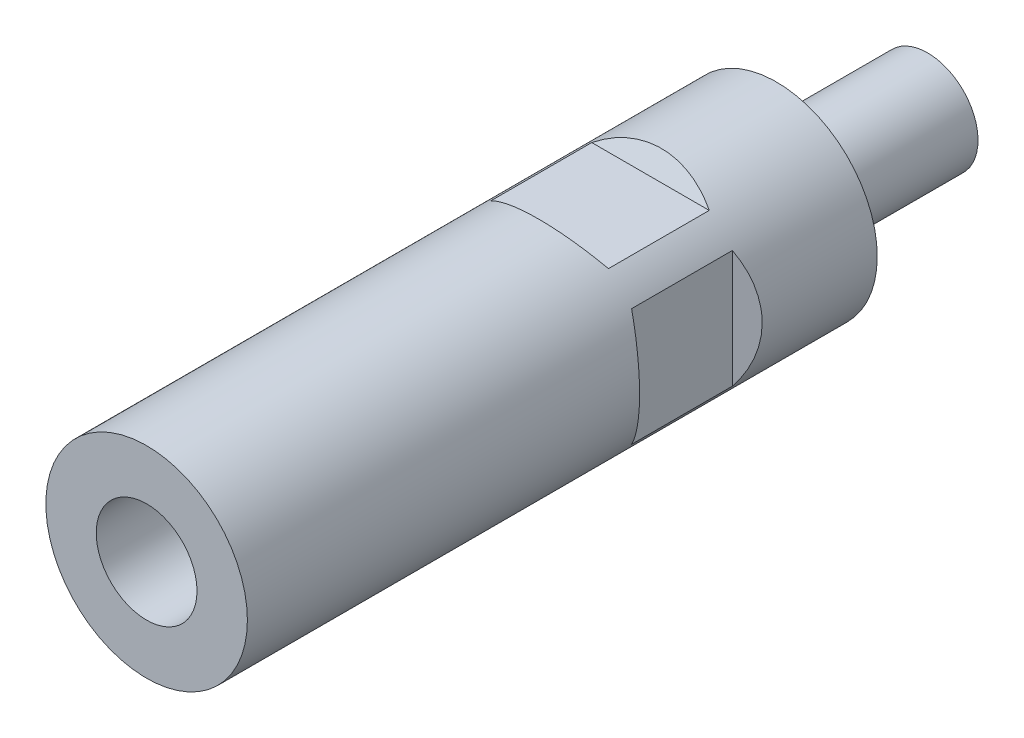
ISO-10303-21;
HEADER;
FILE_DESCRIPTION(('STEP AP214'),'2;1');
FILE_NAME('part.step','',(''),(''),'','','');
FILE_SCHEMA(('AUTOMOTIVE_DESIGN { 1 0 10303 214 1 1 1 1 }'));
ENDSEC;
DATA;
#1=APPLICATION_CONTEXT('core data for automotive mechanical design processes');
#2=APPLICATION_PROTOCOL_DEFINITION('international standard','automotive_design',2000,#1);
#3=PRODUCT_CONTEXT('',#1,'mechanical');
#4=PRODUCT('Part','Part','',(#3));
#5=PRODUCT_RELATED_PRODUCT_CATEGORY('part','',(#4));
#6=PRODUCT_DEFINITION_FORMATION('','',#4);
#7=PRODUCT_DEFINITION_CONTEXT('part definition',#1,'design');
#8=PRODUCT_DEFINITION('design','',#6,#7);
#9=PRODUCT_DEFINITION_SHAPE('','',#8);
#10=(LENGTH_UNIT() NAMED_UNIT(*) SI_UNIT(.MILLI.,.METRE.));
#11=(NAMED_UNIT(*) PLANE_ANGLE_UNIT() SI_UNIT($,.RADIAN.));
#12=(NAMED_UNIT(*) SI_UNIT($,.STERADIAN.) SOLID_ANGLE_UNIT());
#13=UNCERTAINTY_MEASURE_WITH_UNIT(LENGTH_MEASURE(1.E-05),#10,'distance_accuracy_value','');
#14=(GEOMETRIC_REPRESENTATION_CONTEXT(3) GLOBAL_UNCERTAINTY_ASSIGNED_CONTEXT((#13)) GLOBAL_UNIT_ASSIGNED_CONTEXT((#10,
#11,#12)) REPRESENTATION_CONTEXT('',''));
#15=CARTESIAN_POINT('',(0.,0.,0.));
#16=DIRECTION('',(0.,0.,1.));
#17=DIRECTION('',(1.,0.,0.));
#18=AXIS2_PLACEMENT_3D('',#15,#16,#17);
#19=CARTESIAN_POINT('',(0.,0.,8.));
#20=DIRECTION('',(0.,0.,1.));
#21=DIRECTION('',(0.,-1.,0.));
#22=AXIS2_PLACEMENT_3D('',#19,#20,#21);
#23=CYLINDRICAL_SURFACE('',#22,4.);
#24=CARTESIAN_POINT('',(0.,0.,-12.));
#25=DIRECTION('',(0.,0.,1.));
#26=DIRECTION('',(0.,-1.,0.));
#27=AXIS2_PLACEMENT_3D('',#24,#25,#26);
#28=CIRCLE('',#27,4.);
#29=CARTESIAN_POINT('',(0.,-4.,-12.));
#30=VERTEX_POINT('',#29);
#31=EDGE_CURVE('E22',#30,#30,#28,.F.);
#32=ORIENTED_EDGE('',*,*,#31,.F.);
#33=EDGE_LOOP('',(#32));
#34=FACE_BOUND('',#33,.T.);
#35=CARTESIAN_POINT('',(0.,0.,0.));
#36=DIRECTION('',(0.,0.,1.));
#37=DIRECTION('',(1.,0.,0.));
#38=AXIS2_PLACEMENT_3D('',#35,#36,#37);
#39=CIRCLE('',#38,4.);
#40=CARTESIAN_POINT('',(4.,0.,0.));
#41=VERTEX_POINT('',#40);
#42=EDGE_CURVE('E9',#41,#41,#39,.T.);
#43=ORIENTED_EDGE('',*,*,#42,.F.);
#44=EDGE_LOOP('',(#43));
#45=FACE_BOUND('',#44,.T.);
#46=ADVANCED_FACE('F14',(#34,#45),#23,.T.);
#47=CARTESIAN_POINT('',(0.,0.,-12.));
#48=DIRECTION('',(0.,0.,1.));
#49=DIRECTION('',(0.,-1.,0.));
#50=AXIS2_PLACEMENT_3D('',#47,#48,#49);
#51=PLANE('',#50);
#52=ORIENTED_EDGE('',*,*,#31,.T.);
#53=EDGE_LOOP('',(#52));
#54=FACE_BOUND('',#53,.T.);
#55=ADVANCED_FACE('F16',(#54),#51,.F.);
#56=CARTESIAN_POINT('',(3.4,0.,30.));
#57=DIRECTION('',(0.,0.,-1.));
#58=DIRECTION('',(-1.,0.,0.));
#59=AXIS2_PLACEMENT_3D('',#56,#57,#58);
#60=PLANE('',#59);
#61=CARTESIAN_POINT('',(0.,0.,30.));
#62=DIRECTION('',(0.,0.,1.));
#63=DIRECTION('',(1.,0.,0.));
#64=AXIS2_PLACEMENT_3D('',#61,#62,#63);
#65=CIRCLE('',#64,4.);
#66=CARTESIAN_POINT('',(4.,0.,30.));
#67=VERTEX_POINT('',#66);
#68=EDGE_CURVE('E251',#67,#67,#65,.T.);
#69=ORIENTED_EDGE('',*,*,#68,.T.);
#70=EDGE_LOOP('',(#69));
#71=FACE_BOUND('',#70,.T.);
#72=ADVANCED_FACE('F125',(#71),#60,.F.);
#73=CARTESIAN_POINT('',(0.,0.,50.));
#74=DIRECTION('',(0.,0.,1.));
#75=DIRECTION('',(1.,0.,0.));
#76=AXIS2_PLACEMENT_3D('',#73,#74,#75);
#77=CYLINDRICAL_SURFACE('',#76,4.);
#78=ORIENTED_EDGE('',*,*,#68,.F.);
#79=EDGE_LOOP('',(#78));
#80=FACE_BOUND('',#79,.T.);
#81=CARTESIAN_POINT('',(0.,0.,50.));
#82=DIRECTION('',(0.,0.,1.));
#83=DIRECTION('',(1.,0.,0.));
#84=AXIS2_PLACEMENT_3D('',#81,#82,#83);
#85=CIRCLE('',#84,4.);
#86=CARTESIAN_POINT('',(4.,0.,50.));
#87=VERTEX_POINT('',#86);
#88=EDGE_CURVE('E96',#87,#87,#85,.T.);
#89=ORIENTED_EDGE('',*,*,#88,.T.);
#90=EDGE_LOOP('',(#89));
#91=FACE_BOUND('',#90,.T.);
#92=ADVANCED_FACE('F127',(#80,#91),#77,.F.);
#93=CARTESIAN_POINT('',(0.,0.,50.));
#94=DIRECTION('',(0.,0.,1.));
#95=DIRECTION('',(1.,0.,0.));
#96=AXIS2_PLACEMENT_3D('',#93,#94,#95);
#97=PLANE('',#96);
#98=ORIENTED_EDGE('',*,*,#88,.F.);
#99=EDGE_LOOP('',(#98));
#100=FACE_BOUND('',#99,.T.);
#101=CARTESIAN_POINT('',(0.,0.,50.));
#102=DIRECTION('',(0.,0.,1.));
#103=DIRECTION('',(1.,0.,0.));
#104=AXIS2_PLACEMENT_3D('',#101,#102,#103);
#105=CIRCLE('',#104,8.);
#106=CARTESIAN_POINT('',(8.,0.,50.));
#107=VERTEX_POINT('',#106);
#108=EDGE_CURVE('E239',#107,#107,#105,.T.);
#109=ORIENTED_EDGE('',*,*,#108,.T.);
#110=EDGE_LOOP('',(#109));
#111=FACE_BOUND('',#110,.T.);
#112=ADVANCED_FACE('F134',(#100,#111),#97,.T.);
#113=CARTESIAN_POINT('',(6.5,-8.,18.));
#114=DIRECTION('',(-0.5,0.,0.866025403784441));
#115=DIRECTION('',(0.86602540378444,0.,0.5));
#116=AXIS2_PLACEMENT_3D('',#113,#114,#115);
#117=PLANE('',#116);
#118=DIRECTION('',(0.,1.,0.));
#119=VECTOR('',#118,1.);
#120=CARTESIAN_POINT('',(6.5,-8.,18.));
#121=LINE('',#120,#119);
#122=CARTESIAN_POINT('',(6.5,-4.66368952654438,18.));
#123=VERTEX_POINT('',#122);
#124=CARTESIAN_POINT('',(6.5,4.66368952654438,18.));
#125=VERTEX_POINT('',#124);
#126=EDGE_CURVE('E183',#123,#125,#121,.T.);
#127=ORIENTED_EDGE('',*,*,#126,.T.);
#128=CARTESIAN_POINT('',(0.,0.,14.2472232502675));
#129=DIRECTION('',(-0.5,0.,0.866025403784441));
#130=DIRECTION('',(-0.86602540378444,0.,-0.5));
#131=AXIS2_PLACEMENT_3D('',#128,#129,#130);
#132=ELLIPSE('',#131,9.23760430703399,8.);
#133=EDGE_CURVE('E35',#123,#125,#132,.T.);
#134=ORIENTED_EDGE('',*,*,#133,.F.);
#135=EDGE_LOOP('',(#127,#134));
#136=FACE_BOUND('',#135,.T.);
#137=ADVANCED_FACE('F175',(#136),#117,.F.);
#138=CARTESIAN_POINT('',(6.5,-8.,18.));
#139=DIRECTION('',(-1.,0.,0.));
#140=DIRECTION('',(0.,0.,1.));
#141=AXIS2_PLACEMENT_3D('',#138,#139,#140);
#142=PLANE('',#141);
#143=ORIENTED_EDGE('',*,*,#126,.F.);
#144=DIRECTION('',(0.,0.,-1.));
#145=VECTOR('',#144,1.);
#146=CARTESIAN_POINT('',(6.5,-4.66368952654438,50.));
#147=LINE('',#146,#145);
#148=CARTESIAN_POINT('',(6.5,-4.66368952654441,10.));
#149=VERTEX_POINT('',#148);
#150=EDGE_CURVE('E191',#149,#123,#147,.F.);
#151=ORIENTED_EDGE('',*,*,#150,.F.);
#152=DIRECTION('',(0.,1.,0.));
#153=VECTOR('',#152,1.);
#154=CARTESIAN_POINT('',(6.5,-8.,10.));
#155=LINE('',#154,#153);
#156=CARTESIAN_POINT('',(6.5,4.66368952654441,10.));
#157=VERTEX_POINT('',#156);
#158=EDGE_CURVE('E187',#149,#157,#155,.T.);
#159=ORIENTED_EDGE('',*,*,#158,.T.);
#160=DIRECTION('',(0.,0.,-1.));
#161=VECTOR('',#160,1.);
#162=CARTESIAN_POINT('',(6.5,4.66368952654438,50.));
#163=LINE('',#162,#161);
#164=EDGE_CURVE('E29',#125,#157,#163,.T.);
#165=ORIENTED_EDGE('',*,*,#164,.F.);
#166=EDGE_LOOP('',(#143,#151,#159,#165));
#167=FACE_BOUND('',#166,.T.);
#168=ADVANCED_FACE('F172',(#167),#142,.F.);
#169=CARTESIAN_POINT('',(6.5,-8.,10.));
#170=DIRECTION('',(-0.5,0.,-0.866025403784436));
#171=DIRECTION('',(-0.866025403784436,0.,0.5));
#172=AXIS2_PLACEMENT_3D('',#169,#170,#171);
#173=PLANE('',#172);
#174=CARTESIAN_POINT('',(0.,0.,13.7527767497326));
#175=DIRECTION('',(-0.5,0.,-0.866025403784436));
#176=DIRECTION('',(0.866025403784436,0.,-0.5));
#177=AXIS2_PLACEMENT_3D('',#174,#175,#176);
#178=ELLIPSE('',#177,9.23760430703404,8.);
#179=EDGE_CURVE('E195',#157,#149,#178,.T.);
#180=ORIENTED_EDGE('',*,*,#179,.F.);
#181=ORIENTED_EDGE('',*,*,#158,.F.);
#182=EDGE_LOOP('',(#180,#181));
#183=FACE_BOUND('',#182,.T.);
#184=ADVANCED_FACE('F167',(#183),#173,.F.);
#185=CARTESIAN_POINT('',(-6.5,-8.,10.));
#186=DIRECTION('',(0.5,0.,-0.866025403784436));
#187=DIRECTION('',(-0.866025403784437,0.,-0.5));
#188=AXIS2_PLACEMENT_3D('',#185,#186,#187);
#189=PLANE('',#188);
#190=CARTESIAN_POINT('',(0.,0.,13.7527767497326));
#191=DIRECTION('',(0.5,0.,-0.866025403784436));
#192=DIRECTION('',(-0.866025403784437,0.,-0.5));
#193=AXIS2_PLACEMENT_3D('',#190,#191,#192);
#194=ELLIPSE('',#193,9.23760430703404,8.);
#195=CARTESIAN_POINT('',(-6.5,-4.66368952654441,10.));
#196=VERTEX_POINT('',#195);
#197=CARTESIAN_POINT('',(-6.5,4.6636895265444,10.));
#198=VERTEX_POINT('',#197);
#199=EDGE_CURVE('E193',#196,#198,#194,.T.);
#200=ORIENTED_EDGE('',*,*,#199,.F.);
#201=DIRECTION('',(0.,1.,0.));
#202=VECTOR('',#201,1.);
#203=CARTESIAN_POINT('',(-6.5,-8.,10.));
#204=LINE('',#203,#202);
#205=EDGE_CURVE('E227',#196,#198,#204,.T.);
#206=ORIENTED_EDGE('',*,*,#205,.T.);
#207=EDGE_LOOP('',(#200,#206));
#208=FACE_BOUND('',#207,.T.);
#209=ADVANCED_FACE('F163',(#208),#189,.F.);
#210=CARTESIAN_POINT('',(-6.5,-8.,18.));
#211=DIRECTION('',(0.5,0.,0.86602540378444));
#212=DIRECTION('',(0.86602540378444,0.,-0.5));
#213=AXIS2_PLACEMENT_3D('',#210,#211,#212);
#214=PLANE('',#213);
#215=DIRECTION('',(0.,1.,0.));
#216=VECTOR('',#215,1.);
#217=CARTESIAN_POINT('',(-6.5,-8.,18.));
#218=LINE('',#217,#216);
#219=CARTESIAN_POINT('',(-6.5,-4.66368952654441,18.));
#220=VERTEX_POINT('',#219);
#221=CARTESIAN_POINT('',(-6.5,4.66368952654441,18.));
#222=VERTEX_POINT('',#221);
#223=EDGE_CURVE('E231',#220,#222,#218,.T.);
#224=ORIENTED_EDGE('',*,*,#223,.F.);
#225=CARTESIAN_POINT('',(0.,0.,14.2472232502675));
#226=DIRECTION('',(0.5,0.,0.86602540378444));
#227=DIRECTION('',(0.86602540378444,0.,-0.5));
#228=AXIS2_PLACEMENT_3D('',#225,#226,#227);
#229=ELLIPSE('',#228,9.237604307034,8.);
#230=EDGE_CURVE('E206',#222,#220,#229,.T.);
#231=ORIENTED_EDGE('',*,*,#230,.F.);
#232=EDGE_LOOP('',(#224,#231));
#233=FACE_BOUND('',#232,.T.);
#234=ADVANCED_FACE('F160',(#233),#214,.F.);
#235=CARTESIAN_POINT('',(-6.5,-8.,18.));
#236=DIRECTION('',(1.,0.,0.));
#237=DIRECTION('',(0.,0.,-1.));
#238=AXIS2_PLACEMENT_3D('',#235,#236,#237);
#239=PLANE('',#238);
#240=ORIENTED_EDGE('',*,*,#223,.T.);
#241=DIRECTION('',(0.,0.,-1.));
#242=VECTOR('',#241,1.);
#243=CARTESIAN_POINT('',(-6.5,4.66368952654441,50.));
#244=LINE('',#243,#242);
#245=EDGE_CURVE('E200',#198,#222,#244,.F.);
#246=ORIENTED_EDGE('',*,*,#245,.F.);
#247=ORIENTED_EDGE('',*,*,#205,.F.);
#248=DIRECTION('',(0.,0.,-1.));
#249=VECTOR('',#248,1.);
#250=CARTESIAN_POINT('',(-6.5,-4.66368952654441,50.));
#251=LINE('',#250,#249);
#252=EDGE_CURVE('E203',#220,#196,#251,.T.);
#253=ORIENTED_EDGE('',*,*,#252,.F.);
#254=EDGE_LOOP('',(#240,#246,#247,#253));
#255=FACE_BOUND('',#254,.T.);
#256=ADVANCED_FACE('F158',(#255),#239,.F.);
#257=CARTESIAN_POINT('',(8.,6.5,18.));
#258=DIRECTION('',(0.,-0.5,0.86602540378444));
#259=DIRECTION('',(0.,-0.86602540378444,-0.5));
#260=AXIS2_PLACEMENT_3D('',#257,#258,#259);
#261=PLANE('',#260);
#262=DIRECTION('',(-1.,0.,0.));
#263=VECTOR('',#262,1.);
#264=CARTESIAN_POINT('',(8.,6.5,18.));
#265=LINE('',#264,#263);
#266=CARTESIAN_POINT('',(4.66368952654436,6.5,18.));
#267=VERTEX_POINT('',#266);
#268=CARTESIAN_POINT('',(-4.66368952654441,6.5,18.));
#269=VERTEX_POINT('',#268);
#270=EDGE_CURVE('E225',#267,#269,#265,.T.);
#271=ORIENTED_EDGE('',*,*,#270,.T.);
#272=CARTESIAN_POINT('',(0.,0.,14.2472232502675));
#273=DIRECTION('',(0.,-0.5,0.86602540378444));
#274=DIRECTION('',(0.,-0.86602540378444,-0.5));
#275=AXIS2_PLACEMENT_3D('',#272,#273,#274);
#276=ELLIPSE('',#275,9.237604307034,8.);
#277=EDGE_CURVE('E214',#267,#269,#276,.T.);
#278=ORIENTED_EDGE('',*,*,#277,.F.);
#279=EDGE_LOOP('',(#271,#278));
#280=FACE_BOUND('',#279,.T.);
#281=ADVANCED_FACE('F151',(#280),#261,.F.);
#282=CARTESIAN_POINT('',(8.,6.5,18.));
#283=DIRECTION('',(0.,-1.,0.));
#284=DIRECTION('',(1.,0.,0.));
#285=AXIS2_PLACEMENT_3D('',#282,#283,#284);
#286=PLANE('',#285);
#287=ORIENTED_EDGE('',*,*,#270,.F.);
#288=DIRECTION('',(0.,0.,-1.));
#289=VECTOR('',#288,1.);
#290=CARTESIAN_POINT('',(4.66368952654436,6.5,50.));
#291=LINE('',#290,#289);
#292=CARTESIAN_POINT('',(4.66368952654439,6.5,10.));
#293=VERTEX_POINT('',#292);
#294=EDGE_CURVE('E88',#293,#267,#291,.F.);
#295=ORIENTED_EDGE('',*,*,#294,.F.);
#296=DIRECTION('',(-1.,0.,0.));
#297=VECTOR('',#296,1.);
#298=CARTESIAN_POINT('',(8.,6.5,10.));
#299=LINE('',#298,#297);
#300=CARTESIAN_POINT('',(-4.66368952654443,6.5,10.));
#301=VERTEX_POINT('',#300);
#302=EDGE_CURVE('E223',#293,#301,#299,.T.);
#303=ORIENTED_EDGE('',*,*,#302,.T.);
#304=DIRECTION('',(0.,0.,-1.));
#305=VECTOR('',#304,1.);
#306=CARTESIAN_POINT('',(-4.66368952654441,6.5,50.));
#307=LINE('',#306,#305);
#308=EDGE_CURVE('E211',#269,#301,#307,.T.);
#309=ORIENTED_EDGE('',*,*,#308,.F.);
#310=EDGE_LOOP('',(#287,#295,#303,#309));
#311=FACE_BOUND('',#310,.T.);
#312=ADVANCED_FACE('F148',(#311),#286,.F.);
#313=CARTESIAN_POINT('',(8.,6.5,10.));
#314=DIRECTION('',(0.,-0.5,-0.866025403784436));
#315=DIRECTION('',(0.,0.866025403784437,-0.5));
#316=AXIS2_PLACEMENT_3D('',#313,#314,#315);
#317=PLANE('',#316);
#318=CARTESIAN_POINT('',(0.,0.,13.7527767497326));
#319=DIRECTION('',(0.,-0.5,-0.866025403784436));
#320=DIRECTION('',(0.,0.866025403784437,-0.5));
#321=AXIS2_PLACEMENT_3D('',#318,#319,#320);
#322=ELLIPSE('',#321,9.23760430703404,8.);
#323=EDGE_CURVE('E209',#301,#293,#322,.T.);
#324=ORIENTED_EDGE('',*,*,#323,.F.);
#325=ORIENTED_EDGE('',*,*,#302,.F.);
#326=EDGE_LOOP('',(#324,#325));
#327=FACE_BOUND('',#326,.T.);
#328=ADVANCED_FACE('F145',(#327),#317,.F.);
#329=CARTESIAN_POINT('',(8.,-6.5,10.));
#330=DIRECTION('',(0.,0.5,-0.866025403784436));
#331=DIRECTION('',(0.,0.866025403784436,0.5));
#332=AXIS2_PLACEMENT_3D('',#329,#330,#331);
#333=PLANE('',#332);
#334=CARTESIAN_POINT('',(0.,0.,13.7527767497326));
#335=DIRECTION('',(0.,0.5,-0.866025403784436));
#336=DIRECTION('',(0.,-0.866025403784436,-0.5));
#337=AXIS2_PLACEMENT_3D('',#334,#335,#336);
#338=ELLIPSE('',#337,9.23760430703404,8.);
#339=CARTESIAN_POINT('',(4.66368952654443,-6.5,10.));
#340=VERTEX_POINT('',#339);
#341=CARTESIAN_POINT('',(-4.66368952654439,-6.5,10.));
#342=VERTEX_POINT('',#341);
#343=EDGE_CURVE('E79',#340,#342,#338,.T.);
#344=ORIENTED_EDGE('',*,*,#343,.F.);
#345=DIRECTION('',(-1.,0.,0.));
#346=VECTOR('',#345,1.);
#347=CARTESIAN_POINT('',(8.,-6.5,10.));
#348=LINE('',#347,#346);
#349=EDGE_CURVE('E82',#340,#342,#348,.T.);
#350=ORIENTED_EDGE('',*,*,#349,.T.);
#351=EDGE_LOOP('',(#344,#350));
#352=FACE_BOUND('',#351,.T.);
#353=ADVANCED_FACE('F81',(#352),#333,.F.);
#354=CARTESIAN_POINT('',(8.,-6.5,18.));
#355=DIRECTION('',(0.,0.5,0.86602540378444));
#356=DIRECTION('',(0.,-0.86602540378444,0.5));
#357=AXIS2_PLACEMENT_3D('',#354,#355,#356);
#358=PLANE('',#357);
#359=DIRECTION('',(-1.,0.,0.));
#360=VECTOR('',#359,1.);
#361=CARTESIAN_POINT('',(8.,-6.5,18.));
#362=LINE('',#361,#360);
#363=CARTESIAN_POINT('',(4.66368952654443,-6.5,18.));
#364=VERTEX_POINT('',#363);
#365=CARTESIAN_POINT('',(-4.66368952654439,-6.5,18.));
#366=VERTEX_POINT('',#365);
#367=EDGE_CURVE('E95',#364,#366,#362,.T.);
#368=ORIENTED_EDGE('',*,*,#367,.F.);
#369=CARTESIAN_POINT('',(0.,0.,14.2472232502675));
#370=DIRECTION('',(0.,0.5,0.86602540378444));
#371=DIRECTION('',(0.,0.86602540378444,-0.5));
#372=AXIS2_PLACEMENT_3D('',#369,#370,#371);
#373=ELLIPSE('',#372,9.237604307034,8.);
#374=EDGE_CURVE('E101',#366,#364,#373,.T.);
#375=ORIENTED_EDGE('',*,*,#374,.F.);
#376=EDGE_LOOP('',(#368,#375));
#377=FACE_BOUND('',#376,.T.);
#378=ADVANCED_FACE('F139',(#377),#358,.F.);
#379=CARTESIAN_POINT('',(8.,-6.5,18.));
#380=DIRECTION('',(0.,1.,0.));
#381=DIRECTION('',(-1.,0.,0.));
#382=AXIS2_PLACEMENT_3D('',#379,#380,#381);
#383=PLANE('',#382);
#384=ORIENTED_EDGE('',*,*,#367,.T.);
#385=DIRECTION('',(0.,0.,-1.));
#386=VECTOR('',#385,1.);
#387=CARTESIAN_POINT('',(-4.66368952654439,-6.5,50.));
#388=LINE('',#387,#386);
#389=EDGE_CURVE('E87',#342,#366,#388,.F.);
#390=ORIENTED_EDGE('',*,*,#389,.F.);
#391=ORIENTED_EDGE('',*,*,#349,.F.);
#392=DIRECTION('',(0.,0.,-1.));
#393=VECTOR('',#392,1.);
#394=CARTESIAN_POINT('',(4.66368952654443,-6.5,50.));
#395=LINE('',#394,#393);
#396=EDGE_CURVE('E93',#364,#340,#395,.T.);
#397=ORIENTED_EDGE('',*,*,#396,.F.);
#398=EDGE_LOOP('',(#384,#390,#391,#397));
#399=FACE_BOUND('',#398,.T.);
#400=ADVANCED_FACE('F92',(#399),#383,.F.);
#401=CARTESIAN_POINT('',(0.,0.,50.));
#402=DIRECTION('',(0.,0.,-1.));
#403=DIRECTION('',(-1.,0.,0.));
#404=AXIS2_PLACEMENT_3D('',#401,#402,#403);
#405=CYLINDRICAL_SURFACE('',#404,8.);
#406=ORIENTED_EDGE('',*,*,#389,.T.);
#407=ORIENTED_EDGE('',*,*,#374,.T.);
#408=ORIENTED_EDGE('',*,*,#396,.T.);
#409=ORIENTED_EDGE('',*,*,#343,.T.);
#410=EDGE_LOOP('',(#406,#407,#408,#409));
#411=FACE_BOUND('',#410,.T.);
#412=ORIENTED_EDGE('',*,*,#323,.T.);
#413=ORIENTED_EDGE('',*,*,#294,.T.);
#414=ORIENTED_EDGE('',*,*,#277,.T.);
#415=ORIENTED_EDGE('',*,*,#308,.T.);
#416=EDGE_LOOP('',(#412,#413,#414,#415));
#417=FACE_BOUND('',#416,.T.);
#418=ORIENTED_EDGE('',*,*,#245,.T.);
#419=ORIENTED_EDGE('',*,*,#230,.T.);
#420=ORIENTED_EDGE('',*,*,#252,.T.);
#421=ORIENTED_EDGE('',*,*,#199,.T.);
#422=EDGE_LOOP('',(#418,#419,#420,#421));
#423=FACE_BOUND('',#422,.T.);
#424=ORIENTED_EDGE('',*,*,#179,.T.);
#425=ORIENTED_EDGE('',*,*,#150,.T.);
#426=ORIENTED_EDGE('',*,*,#133,.T.);
#427=ORIENTED_EDGE('',*,*,#164,.T.);
#428=EDGE_LOOP('',(#424,#425,#426,#427));
#429=FACE_BOUND('',#428,.T.);
#430=ORIENTED_EDGE('',*,*,#108,.F.);
#431=EDGE_LOOP('',(#430));
#432=FACE_BOUND('',#431,.T.);
#433=CARTESIAN_POINT('',(0.,0.,0.));
#434=DIRECTION('',(0.,0.,1.));
#435=DIRECTION('',(1.,0.,0.));
#436=AXIS2_PLACEMENT_3D('',#433,#434,#435);
#437=CIRCLE('',#436,8.);
#438=CARTESIAN_POINT('',(8.,0.,0.));
#439=VERTEX_POINT('',#438);
#440=EDGE_CURVE('E186',#439,#439,#437,.T.);
#441=ORIENTED_EDGE('',*,*,#440,.T.);
#442=EDGE_LOOP('',(#441));
#443=FACE_BOUND('',#442,.T.);
#444=ADVANCED_FACE('F99',(#411,#417,#423,#429,#432,#443),#405,.T.);
#445=CARTESIAN_POINT('',(0.,0.,0.));
#446=DIRECTION('',(0.,0.,1.));
#447=DIRECTION('',(1.,0.,0.));
#448=AXIS2_PLACEMENT_3D('',#445,#446,#447);
#449=PLANE('',#448);
#450=ORIENTED_EDGE('',*,*,#440,.F.);
#451=EDGE_LOOP('',(#450));
#452=FACE_BOUND('',#451,.T.);
#453=ORIENTED_EDGE('',*,*,#42,.T.);
#454=EDGE_LOOP('',(#453));
#455=FACE_BOUND('',#454,.T.);
#456=ADVANCED_FACE('F111',(#452,#455),#449,.F.);
#457=CLOSED_SHELL('',(#46,#55,#72,#92,#112,#137,#168,#184,#209,#234,#256,#281,#312,#328,#353,
#378,#400,#444,#456));
#458=MANIFOLD_SOLID_BREP('B1',#457);
#459=ADVANCED_BREP_SHAPE_REPRESENTATION('',(#18,#458),#14);
#460=SHAPE_DEFINITION_REPRESENTATION(#9,#459);
ENDSEC;
END-ISO-10303-21;
